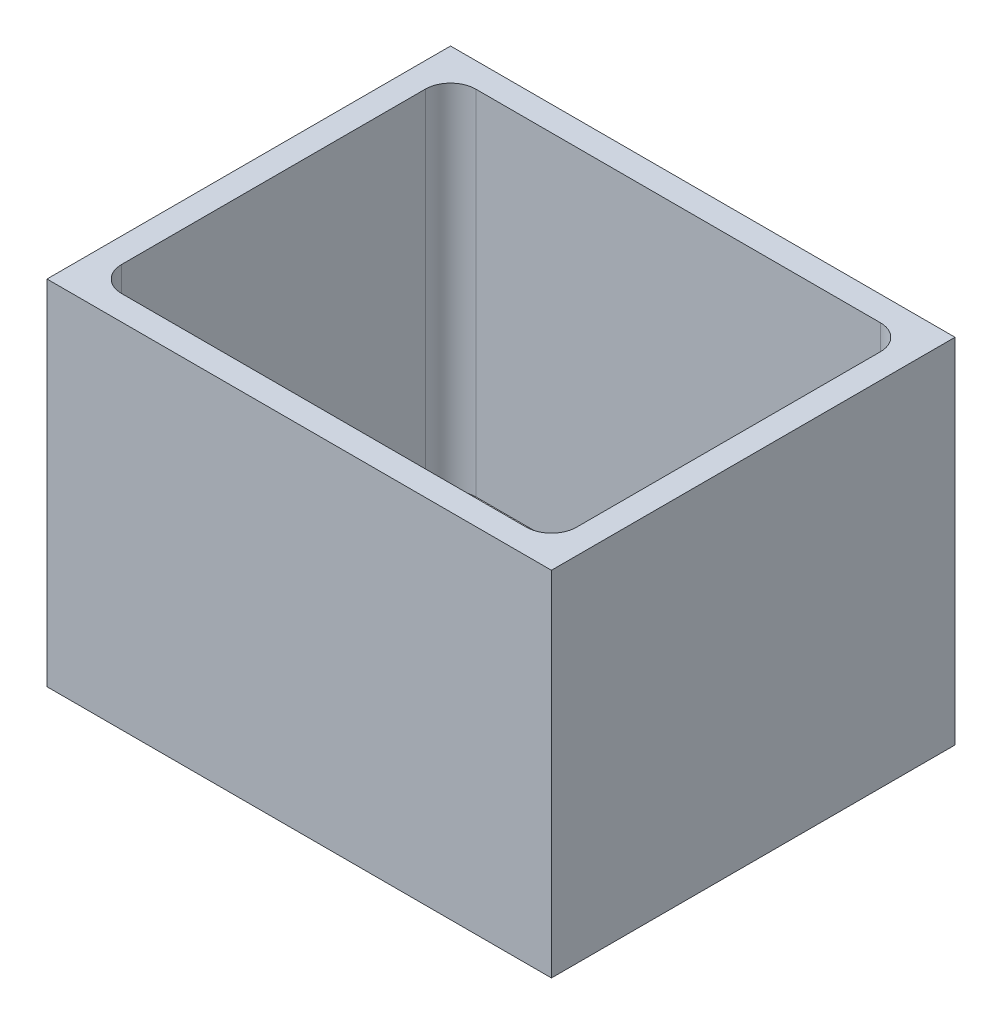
from build123d import *

# Parameters (mm, degrees)
SKETCH1_W           = 127
SKETCH1_H           = 101.6
BOSS_EXTRUDE1_DEPTH = 88.9
CUT_EXTRUDE1_DEPTH  = 135.9600795


with BuildPart() as part:
    # Sketch1 → Boss-Extrude1 (new body)
    with BuildSketch(Plane(origin=(0, 0, 0), x_dir=(1, 0, 0), z_dir=(0, 1, 0))):
        with Locations((-12.796211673, -16.20672461)):
            Rectangle(SKETCH1_W, SKETCH1_H)
    extrude(amount=BOSS_EXTRUDE1_DEPTH)

    # Sketch2 → Cut-Extrude1 (cut, through all)
    with BuildSketch(Plane(origin=(0, 88.9, 0), x_dir=(1, 0, 0), z_dir=(0, 1, 0))):
        with BuildLine():
            Line((38.130788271, 28.37027539), (-63.723211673, 28.37027539))
            ThreePointArc((-63.723211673, 28.37027539), (-68.213339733, 26.51040345), (-70.073211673, 22.02027539))
            Line((-70.073211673, 22.02027539), (-70.073211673, -54.43372461))
            ThreePointArc((-70.073211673, -54.43372461), (-68.213339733, -58.923852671), (-63.723211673, -60.78372461))
            Line((-63.723211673, -60.78372461), (38.13078825, -60.78372461))
            ThreePointArc((38.13078825, -60.78372461), (42.62091636, -58.923852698), (44.480788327, -54.43372461))
            Line((44.480788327, -54.43372461), (44.480788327, 22.02027539))
            ThreePointArc((44.480788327, 22.02027539), (42.620916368, 26.51040347), (38.130788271, 28.37027539))
        make_face()
    extrude(amount=-CUT_EXTRUDE1_DEPTH, mode=Mode.SUBTRACT)


solid = part.part
